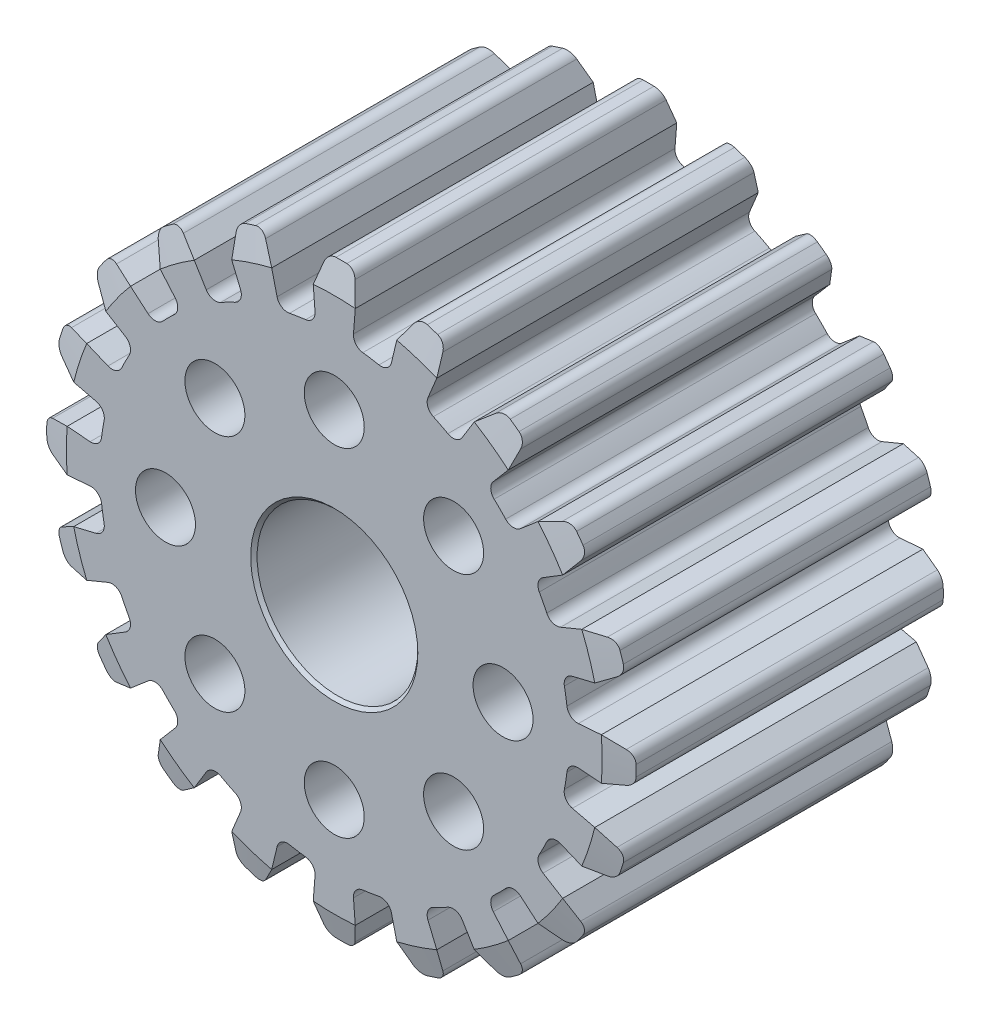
from build123d import *

# Parameters (mm, degrees)
SKETCH2_R            = 32.5
CUT_EXTRUDE1_DEPTH   = 30
SKETCH3_W            = 3
SKETCH3_H            = 20
M5_CLEARANCE_HOLE1_D = 5.6
CIRPATTERN1_COUNT    = 8


with BuildPart() as part:
    # Sketch1 → Revolve1 (revolve)
    with BuildSketch(Plane(origin=(0, 0, 0), x_dir=(0, 0, -1), z_dir=(1, 0, 0)), mode=Mode.PRIVATE) as revolve1_sk:
        Polygon((-30, 25), (-30, 7.8), (-29.7, 7.5), (-0.3, 7.5), (0, 7.8), (0, 25), (-1.205771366, 29.5), (-28.794228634, 29.5), align=None)
    revolve(revolve1_sk.sketch.rotate(Axis((0, 0, 0), (0, 0, 1)), 270), axis=Axis((0, 0, 0), (0, 0, 1)))

    # Sketch2 → Cut-Extrude1 (cut)
    with BuildSketch(Plane.XY):
        Circle(SKETCH2_R)
        with BuildLine():
            Line((-26.762751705, -1.451250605), (-24.922933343, -1.961477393))
            Line((-24.922933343, -1.961477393), (-22.782683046, -1.793036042))
            ThreePointArc((-22.782683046, -1.793036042), (-22.071556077, -2.01553013), (-21.711689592, -2.667988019))
            ThreePointArc((-21.711689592, -2.667988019), (-21.605682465, -3.422003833), (-21.47349754, -4.17187349))
            ThreePointArc((-21.47349754, -4.17187349), (-21.614130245, -4.903602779), (-22.221697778, -5.334957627))
            Line((-22.221697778, -5.334957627), (-24.30924801, -5.836134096))
            Line((-24.30924801, -5.836134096), (-25.901350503, -6.889923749))
            ThreePointArc((-25.901350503, -6.889923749), (-26.290429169, -7.385446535), (-26.30599516, -8.015274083))
            ThreePointArc((-26.30599516, -8.015274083), (-26.154054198, -8.497967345), (-25.993257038, -8.977783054))
            ThreePointArc((-25.993257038, -8.977783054), (-25.610460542, -9.478174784), (-25.004428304, -9.650366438))
            Line((-25.004428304, -9.650366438), (-23.096988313, -9.567085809))
            Line((-23.096988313, -9.567085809), (-21.113540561, -8.74551485))
            ThreePointArc((-21.113540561, -8.74551485), (-20.36846418, -8.73736898), (-19.824590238, -9.24668843))
            ThreePointArc((-19.824590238, -9.24668843), (-19.490767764, -9.93104209), (-19.133329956, -10.603363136))
            ThreePointArc((-19.133329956, -10.603363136), (-19.040962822, -11.342736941), (-19.485497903, -11.940728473))
            Line((-19.485497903, -11.940728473), (-21.316004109, -13.062464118))
            Line((-21.316004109, -13.062464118), (-22.504544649, -14.556664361))
            ThreePointArc((-22.504544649, -14.556664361), (-22.721455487, -15.148166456), (-22.541632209, -15.751978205))
            ThreePointArc((-22.541632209, -15.751978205), (-22.247967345, -16.164094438), (-21.94676895, -16.57073724))
            ThreePointArc((-21.94676895, -16.57073724), (-21.4280783, -16.928347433), (-20.798497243, -16.904837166))
            Line((-20.798497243, -16.904837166), (-19.01014914, -16.236201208))
            Line((-19.01014914, -16.236201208), (-17.377657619, -14.841921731))
            ThreePointArc((-17.377657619, -14.841921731), (-16.671565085, -14.603933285), (-15.996921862, -14.920258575))
            ThreePointArc((-15.996921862, -14.920258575), (-15.467960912, -15.467960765), (-14.920258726, -15.996921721))
            ThreePointArc((-14.920258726, -15.996921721), (-14.60393329, -16.671564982), (-14.841921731, -17.377657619))
            Line((-14.841921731, -17.377657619), (-16.236201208, -19.01014914))
            Line((-16.236201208, -19.01014914), (-16.904837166, -20.798497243))
            ThreePointArc((-16.904837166, -20.798497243), (-16.928347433, -21.4280783), (-16.57073724, -21.94676895))
            ThreePointArc((-16.57073724, -21.94676895), (-16.164094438, -22.247967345), (-15.751978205, -22.541632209))
            ThreePointArc((-15.751978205, -22.541632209), (-15.148166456, -22.721455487), (-14.556664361, -22.504544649))
            Line((-14.556664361, -22.504544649), (-13.062464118, -21.316004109))
            Line((-13.062464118, -21.316004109), (-11.940728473, -19.485497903))
            ThreePointArc((-11.940728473, -19.485497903), (-11.342737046, -19.040962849), (-10.603363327, -19.13332985))
            ThreePointArc((-10.603363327, -19.13332985), (-9.931042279, -19.490767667), (-9.246688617, -19.82459015))
            ThreePointArc((-9.246688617, -19.82459015), (-8.737369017, -20.368464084), (-8.74551485, -21.113540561))
            Line((-8.74551485, -21.113540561), (-9.567085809, -23.096988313))
            Line((-9.567085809, -23.096988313), (-9.650366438, -25.004428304))
            ThreePointArc((-9.650366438, -25.004428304), (-9.478174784, -25.610460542), (-8.977783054, -25.993257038))
            ThreePointArc((-8.977783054, -25.993257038), (-8.497967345, -26.154054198), (-8.015274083, -26.30599516))
            ThreePointArc((-8.015274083, -26.30599516), (-7.385446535, -26.290429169), (-6.889923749, -25.901350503))
            Line((-6.889923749, -25.901350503), (-5.836134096, -24.30924801))
            Line((-5.836134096, -24.30924801), (-5.334957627, -22.221697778))
            ThreePointArc((-5.334957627, -22.221697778), (-4.903602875, -21.614130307), (-4.171873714, -21.473497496))
            ThreePointArc((-4.171873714, -21.473497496), (-3.422004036, -21.605682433), (-2.667988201, -21.711689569))
            ThreePointArc((-2.667988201, -21.711689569), (-2.015530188, -22.071556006), (-1.793036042, -22.782683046))
            Line((-1.793036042, -22.782683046), (-1.961477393, -24.922933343))
            Line((-1.961477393, -24.922933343), (-1.451250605, -26.762751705))
            ThreePointArc((-1.451250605, -26.762751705), (-1.10021235, -27.285912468), (-0.506020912, -27.495344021))
            ThreePointArc((-0.506020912, -27.495344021), (0, -27.5), (0.506020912, -27.495344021))
            ThreePointArc((0.506020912, -27.495344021), (1.10021235, -27.285912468), (1.451250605, -26.762751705))
            Line((1.451250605, -26.762751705), (1.961477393, -24.922933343))
            Line((1.961477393, -24.922933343), (1.793036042, -22.782683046))
            ThreePointArc((1.793036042, -22.782683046), (2.015530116, -22.071556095), (2.667987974, -21.711689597))
            ThreePointArc((2.667987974, -21.711689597), (3.42200381, -21.605682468), (4.17187349, -21.47349754))
            ThreePointArc((4.17187349, -21.47349754), (4.903602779, -21.614130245), (5.334957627, -22.221697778))
            Line((5.334957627, -22.221697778), (5.836134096, -24.30924801))
            Line((5.836134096, -24.30924801), (6.889923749, -25.901350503))
            ThreePointArc((6.889923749, -25.901350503), (7.385446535, -26.290429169), (8.015274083, -26.30599516))
            ThreePointArc((8.015274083, -26.30599516), (8.497967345, -26.154054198), (8.977783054, -25.993257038))
            ThreePointArc((8.977783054, -25.993257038), (9.478174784, -25.610460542), (9.650366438, -25.004428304))
            Line((9.650366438, -25.004428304), (9.567085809, -23.096988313))
            Line((9.567085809, -23.096988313), (8.74551485, -21.113540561))
            ThreePointArc((8.74551485, -21.113540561), (8.737368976, -20.36846419), (9.24668841, -19.824590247))
            ThreePointArc((9.24668841, -19.824590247), (9.93104208, -19.490767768), (10.603363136, -19.133329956))
            ThreePointArc((10.603363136, -19.133329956), (11.342736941, -19.040962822), (11.940728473, -19.485497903))
            Line((11.940728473, -19.485497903), (13.062464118, -21.316004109))
            Line((13.062464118, -21.316004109), (14.556664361, -22.504544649))
            ThreePointArc((14.556664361, -22.504544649), (15.148166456, -22.721455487), (15.751978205, -22.541632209))
            ThreePointArc((15.751978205, -22.541632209), (16.164094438, -22.247967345), (16.57073724, -21.94676895))
            ThreePointArc((16.57073724, -21.94676895), (16.928347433, -21.4280783), (16.904837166, -20.798497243))
            Line((16.904837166, -20.798497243), (16.236201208, -19.01014914))
            Line((16.236201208, -19.01014914), (14.841921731, -17.377657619))
            ThreePointArc((14.841921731, -17.377657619), (14.603933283, -16.671565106), (14.920258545, -15.99692189))
            ThreePointArc((14.920258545, -15.99692189), (15.467960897, -15.46796078), (15.996922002, -14.920258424))
            ThreePointArc((15.996922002, -14.920258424), (16.671565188, -14.603933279), (17.377657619, -14.841921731))
            Line((17.377657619, -14.841921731), (19.01014914, -16.236201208))
            Line((19.01014914, -16.236201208), (20.798497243, -16.904837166))
            ThreePointArc((20.798497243, -16.904837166), (21.4280783, -16.928347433), (21.94676895, -16.57073724))
            ThreePointArc((21.94676895, -16.57073724), (22.247967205, -16.164094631), (22.541631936, -15.751978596))
            ThreePointArc((22.541631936, -15.751978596), (22.721455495, -15.148166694), (22.504544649, -14.556664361))
            Line((22.504544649, -14.556664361), (21.316004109, -13.062464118))
            Line((21.316004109, -13.062464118), (19.485497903, -11.940728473))
            ThreePointArc((19.485497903, -11.940728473), (19.040962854, -11.342737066), (19.133329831, -10.603363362))
            ThreePointArc((19.133329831, -10.603363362), (19.490767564, -9.931042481), (19.824589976, -9.246688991))
            ThreePointArc((19.824589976, -9.246688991), (20.368463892, -8.737369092), (21.113540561, -8.74551485))
            Line((21.113540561, -8.74551485), (23.096988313, -9.567085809))
            Line((23.096988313, -9.567085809), (25.004428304, -9.650366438))
            ThreePointArc((25.004428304, -9.650366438), (25.610460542, -9.478174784), (25.993257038, -8.977783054))
            ThreePointArc((25.993257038, -8.977783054), (26.154054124, -8.497967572), (26.305995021, -8.015274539))
            ThreePointArc((26.305995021, -8.015274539), (26.29042925, -7.385446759), (25.901350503, -6.889923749))
            Line((25.901350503, -6.889923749), (24.30924801, -5.836134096))
            Line((24.30924801, -5.836134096), (22.221697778, -5.334957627))
            ThreePointArc((22.221697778, -5.334957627), (21.614130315, -4.903602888), (21.47349749, -4.171873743))
            ThreePointArc((21.47349749, -4.171873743), (21.605682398, -3.422004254), (21.711689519, -2.66798861))
            ThreePointArc((21.711689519, -2.66798861), (22.071555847, -2.015530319), (22.782683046, -1.793036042))
            Line((22.782683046, -1.793036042), (24.922933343, -1.961477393))
            Line((24.922933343, -1.961477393), (26.762751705, -1.451250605))
            ThreePointArc((26.762751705, -1.451250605), (27.285912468, -1.10021235), (27.495344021, -0.506020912))
            ThreePointArc((27.495344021, -0.506020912), (27.5, 0), (27.495344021, 0.506020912))
            ThreePointArc((27.495344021, 0.506020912), (27.285912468, 1.10021235), (26.762751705, 1.451250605))
            Line((26.762751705, 1.451250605), (24.922933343, 1.961477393))
            Line((24.922933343, 1.961477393), (22.782683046, 1.793036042))
            ThreePointArc((22.782683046, 1.793036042), (22.071556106, 2.015530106), (21.711689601, 2.667987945))
            ThreePointArc((21.711689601, 2.667987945), (21.605682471, 3.422003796), (21.47349754, 4.17187349))
            ThreePointArc((21.47349754, 4.17187349), (21.614130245, 4.903602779), (22.221697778, 5.334957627))
            Line((22.221697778, 5.334957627), (24.30924801, 5.836134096))
            Line((24.30924801, 5.836134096), (25.901350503, 6.889923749))
            ThreePointArc((25.901350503, 6.889923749), (26.290429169, 7.385446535), (26.30599516, 8.015274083))
            ThreePointArc((26.30599516, 8.015274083), (26.154054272, 8.497967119), (25.993257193, 8.977782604))
            ThreePointArc((25.993257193, 8.977782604), (25.61046074, 9.47817465), (25.004428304, 9.650366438))
            Line((25.004428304, 9.650366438), (23.096988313, 9.567085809))
            Line((23.096988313, 9.567085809), (21.113540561, 8.74551485))
            ThreePointArc((21.113540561, 8.74551485), (20.368464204, 8.737368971), (19.824590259, 9.246688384))
            ThreePointArc((19.824590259, 9.246688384), (19.490767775, 9.931042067), (19.133329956, 10.603363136))
            ThreePointArc((19.133329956, 10.603363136), (19.040962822, 11.342736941), (19.485497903, 11.940728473))
            Line((19.485497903, 11.940728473), (21.316004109, 13.062464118))
            Line((21.316004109, 13.062464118), (22.504544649, 14.556664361))
            ThreePointArc((22.504544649, 14.556664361), (22.721455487, 15.148166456), (22.541632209, 15.751978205))
            ThreePointArc((22.541632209, 15.751978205), (22.247967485, 16.164094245), (21.946769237, 16.570736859))
            ThreePointArc((21.946769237, 16.570736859), (21.428078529, 16.928347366), (20.798497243, 16.904837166))
            Line((20.798497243, 16.904837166), (19.01014914, 16.236201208))
            Line((19.01014914, 16.236201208), (17.377657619, 14.841921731))
            ThreePointArc((17.377657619, 14.841921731), (16.671565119, 14.603933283), (15.996921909, 14.920258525))
            ThreePointArc((15.996921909, 14.920258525), (15.467960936, 15.467960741), (14.920258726, 15.996921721))
            ThreePointArc((14.920258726, 15.996921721), (14.60393329, 16.671564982), (14.841921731, 17.377657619))
            Line((14.841921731, 17.377657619), (16.236201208, 19.01014914))
            Line((16.236201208, 19.01014914), (16.904837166, 20.798497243))
            ThreePointArc((16.904837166, 20.798497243), (16.928347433, 21.4280783), (16.57073724, 21.94676895))
            ThreePointArc((16.57073724, 21.94676895), (16.164094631, 22.247967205), (15.751978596, 22.541631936))
            ThreePointArc((15.751978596, 22.541631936), (15.148166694, 22.721455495), (14.556664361, 22.504544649))
            Line((14.556664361, 22.504544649), (13.062464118, 21.316004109))
            Line((13.062464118, 21.316004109), (11.940728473, 19.485497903))
            ThreePointArc((11.940728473, 19.485497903), (11.342737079, 19.040962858), (10.603363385, 19.133329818))
            ThreePointArc((10.603363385, 19.133329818), (9.931042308, 19.490767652), (9.246688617, 19.82459015))
            ThreePointArc((9.246688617, 19.82459015), (8.737369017, 20.368464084), (8.74551485, 21.113540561))
            Line((8.74551485, 21.113540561), (9.567085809, 23.096988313))
            Line((9.567085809, 23.096988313), (9.650366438, 25.004428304))
            ThreePointArc((9.650366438, 25.004428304), (9.478174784, 25.610460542), (8.977783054, 25.993257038))
            ThreePointArc((8.977783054, 25.993257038), (8.497967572, 26.154054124), (8.015274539, 26.305995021))
            ThreePointArc((8.015274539, 26.305995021), (7.385446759, 26.29042925), (6.889923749, 25.901350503))
            Line((6.889923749, 25.901350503), (5.836134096, 24.30924801))
            Line((5.836134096, 24.30924801), (5.334957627, 22.221697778))
            ThreePointArc((5.334957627, 22.221697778), (4.903602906, 21.614130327), (4.171873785, 21.473497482))
            ThreePointArc((4.171873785, 21.473497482), (3.422004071, 21.605682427), (2.667988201, 21.711689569))
            ThreePointArc((2.667988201, 21.711689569), (2.015530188, 22.071556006), (1.793036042, 22.782683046))
            Line((1.793036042, 22.782683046), (1.961477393, 24.922933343))
            Line((1.961477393, 24.922933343), (1.451250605, 26.762751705))
            ThreePointArc((1.451250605, 26.762751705), (1.10021235, 27.285912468), (0.506020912, 27.495344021))
            ThreePointArc((0.506020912, 27.495344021), (0, 27.5), (-0.506020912, 27.495344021))
            ThreePointArc((-0.506020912, 27.495344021), (-1.10021235, 27.285912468), (-1.451250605, 26.762751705))
            Line((-1.451250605, 26.762751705), (-1.961477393, 24.922933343))
            Line((-1.961477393, 24.922933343), (-1.793036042, 22.782683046))
            ThreePointArc((-1.793036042, 22.782683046), (-2.015530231, 22.071555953), (-2.667988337, 21.711689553))
            ThreePointArc((-2.667988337, 21.711689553), (-3.422003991, 21.60568244), (-4.17187349, 21.47349754))
            ThreePointArc((-4.17187349, 21.47349754), (-4.903602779, 21.614130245), (-5.334957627, 22.221697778))
            Line((-5.334957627, 22.221697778), (-5.836134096, 24.30924801))
            Line((-5.836134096, 24.30924801), (-6.889923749, 25.901350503))
            ThreePointArc((-6.889923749, 25.901350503), (-7.385446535, 26.290429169), (-8.015274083, 26.30599516))
            ThreePointArc((-8.015274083, 26.30599516), (-8.497967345, 26.154054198), (-8.977783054, 25.993257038))
            ThreePointArc((-8.977783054, 25.993257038), (-9.478174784, 25.610460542), (-9.650366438, 25.004428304))
            Line((-9.650366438, 25.004428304), (-9.567085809, 23.096988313))
            Line((-9.567085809, 23.096988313), (-8.74551485, 21.113540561))
            ThreePointArc((-8.74551485, 21.113540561), (-8.737368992, 20.368464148), (-9.246688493, 19.824590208))
            ThreePointArc((-9.246688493, 19.824590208), (-9.931042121, 19.490767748), (-10.603363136, 19.133329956))
            ThreePointArc((-10.603363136, 19.133329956), (-11.342736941, 19.040962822), (-11.940728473, 19.485497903))
            Line((-11.940728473, 19.485497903), (-13.062464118, 21.316004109))
            Line((-13.062464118, 21.316004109), (-14.556664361, 22.504544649))
            ThreePointArc((-14.556664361, 22.504544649), (-15.148166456, 22.721455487), (-15.751978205, 22.541632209))
            ThreePointArc((-15.751978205, 22.541632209), (-16.164094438, 22.247967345), (-16.57073724, 21.94676895))
            ThreePointArc((-16.57073724, 21.94676895), (-16.928347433, 21.4280783), (-16.904837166, 20.798497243))
            Line((-16.904837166, 20.798497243), (-16.236201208, 19.01014914))
            Line((-16.236201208, 19.01014914), (-14.841921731, 17.377657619))
            ThreePointArc((-14.841921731, 17.377657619), (-14.603933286, 16.671565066), (-14.920258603, 15.996921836))
            ThreePointArc((-14.920258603, 15.996921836), (-15.467960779, 15.467960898), (-15.996921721, 14.920258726))
            ThreePointArc((-15.996921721, 14.920258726), (-16.671564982, 14.60393329), (-17.377657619, 14.841921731))
            Line((-17.377657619, 14.841921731), (-19.01014914, 16.236201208))
            Line((-19.01014914, 16.236201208), (-20.798497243, 16.904837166))
            ThreePointArc((-20.798497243, 16.904837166), (-21.4280783, 16.928347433), (-21.94676895, 16.57073724))
            ThreePointArc((-21.94676895, 16.57073724), (-22.247967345, 16.164094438), (-22.541632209, 15.751978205))
            ThreePointArc((-22.541632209, 15.751978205), (-22.721455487, 15.148166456), (-22.504544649, 14.556664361))
            Line((-22.504544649, 14.556664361), (-21.316004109, 13.062464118))
            Line((-21.316004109, 13.062464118), (-19.485497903, 11.940728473))
            ThreePointArc((-19.485497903, 11.940728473), (-19.040962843, 11.342737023), (-19.133329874, 10.603363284))
            ThreePointArc((-19.133329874, 10.603363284), (-19.490767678, 9.931042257), (-19.82459015, 9.246688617))
            ThreePointArc((-19.82459015, 9.246688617), (-20.368464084, 8.737369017), (-21.113540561, 8.74551485))
            Line((-21.113540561, 8.74551485), (-23.096988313, 9.567085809))
            Line((-23.096988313, 9.567085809), (-25.004428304, 9.650366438))
            ThreePointArc((-25.004428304, 9.650366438), (-25.610460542, 9.478174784), (-25.993257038, 8.977783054))
            ThreePointArc((-25.993257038, 8.977783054), (-26.154054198, 8.497967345), (-26.30599516, 8.015274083))
            ThreePointArc((-26.30599516, 8.015274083), (-26.290429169, 7.385446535), (-25.901350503, 6.889923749))
            Line((-25.901350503, 6.889923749), (-24.30924801, 5.836134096))
            Line((-24.30924801, 5.836134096), (-22.221697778, 5.334957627))
            ThreePointArc((-22.221697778, 5.334957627), (-21.614130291, 4.90360285), (-21.473497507, 4.171873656))
            ThreePointArc((-21.473497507, 4.171873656), (-21.605682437, 3.422004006), (-21.711689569, 2.667988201))
            ThreePointArc((-21.711689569, 2.667988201), (-22.071556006, 2.015530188), (-22.782683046, 1.793036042))
            Line((-22.782683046, 1.793036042), (-24.922933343, 1.961477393))
            Line((-24.922933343, 1.961477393), (-26.762751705, 1.451250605))
            ThreePointArc((-26.762751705, 1.451250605), (-27.285912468, 1.10021235), (-27.495344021, 0.506020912))
            ThreePointArc((-27.495344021, 0.506020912), (-27.5, 0), (-27.495344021, -0.506020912))
            ThreePointArc((-27.495344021, -0.506020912), (-27.285912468, -1.10021235), (-26.762751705, -1.451250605))
        make_face(mode=Mode.SUBTRACT)
    extrude(amount=CUT_EXTRUDE1_DEPTH, mode=Mode.SUBTRACT)

    # Sketch3 → Cut-Revolve1 (revolve, cut)
    with BuildSketch(Plane(origin=(0, 0, 0), x_dir=(0, 0, -1), z_dir=(1, 0, 0)), mode=Mode.PRIVATE) as cut_revolve1_sk:
        with Locations((-1.5, 10)):
            Rectangle(SKETCH3_W, SKETCH3_H)
    revolve(cut_revolve1_sk.sketch.rotate(Axis((0, 0, 0), (0, 0, 1)), 270), axis=Axis((0, 0, 0), (0, 0, 1)), mode=Mode.SUBTRACT)

    # M5 Clearance Hole1 (through all)
    with Locations(Plane.XY.offset(30)):
        with Locations((0, -15.75)):
            m5_clearance_hole1 = Hole(M5_CLEARANCE_HOLE1_D / 2)

    # CirPattern1: M5 Clearance Hole1 ×8 about axis
    cirpattern1_axis = Axis((0, 0, 0), (0, 0, 1))
    for i in range(1, CIRPATTERN1_COUNT):
        add(m5_clearance_hole1.rotate(cirpattern1_axis, i * 360 / CIRPATTERN1_COUNT), mode=Mode.SUBTRACT)


solid = part.part
